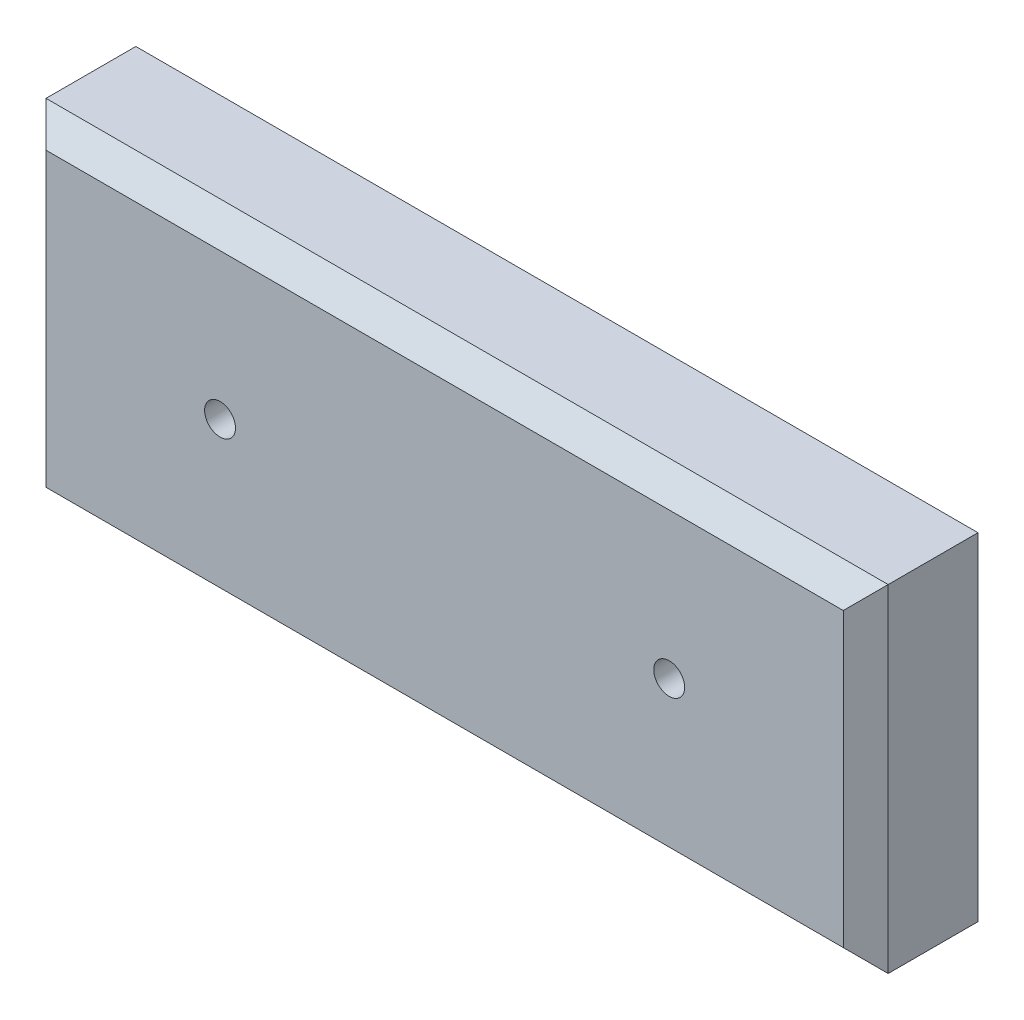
ISO-10303-21;
HEADER;
FILE_DESCRIPTION(('STEP AP214'),'2;1');
FILE_NAME('part.step','',(''),(''),'','','');
FILE_SCHEMA(('AUTOMOTIVE_DESIGN { 1 0 10303 214 1 1 1 1 }'));
ENDSEC;
DATA;
#1=APPLICATION_CONTEXT('core data for automotive mechanical design processes');
#2=APPLICATION_PROTOCOL_DEFINITION('international standard','automotive_design',2000,#1);
#3=PRODUCT_CONTEXT('',#1,'mechanical');
#4=PRODUCT('Part','Part','',(#3));
#5=PRODUCT_RELATED_PRODUCT_CATEGORY('part','',(#4));
#6=PRODUCT_DEFINITION_FORMATION('','',#4);
#7=PRODUCT_DEFINITION_CONTEXT('part definition',#1,'design');
#8=PRODUCT_DEFINITION('design','',#6,#7);
#9=PRODUCT_DEFINITION_SHAPE('','',#8);
#10=(LENGTH_UNIT() NAMED_UNIT(*) SI_UNIT(.MILLI.,.METRE.));
#11=(NAMED_UNIT(*) PLANE_ANGLE_UNIT() SI_UNIT($,.RADIAN.));
#12=(NAMED_UNIT(*) SI_UNIT($,.STERADIAN.) SOLID_ANGLE_UNIT());
#13=UNCERTAINTY_MEASURE_WITH_UNIT(LENGTH_MEASURE(1.E-05),#10,'distance_accuracy_value','');
#14=(GEOMETRIC_REPRESENTATION_CONTEXT(3) GLOBAL_UNCERTAINTY_ASSIGNED_CONTEXT((#13)) GLOBAL_UNIT_ASSIGNED_CONTEXT((#10,
#11,#12)) REPRESENTATION_CONTEXT('',''));
#15=CARTESIAN_POINT('',(0.,0.,0.));
#16=DIRECTION('',(0.,0.,1.));
#17=DIRECTION('',(1.,0.,0.));
#18=AXIS2_PLACEMENT_3D('',#15,#16,#17);
#19=CARTESIAN_POINT('',(-75.,-30.0000000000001,19.9999999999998));
#20=DIRECTION('',(0.,1.,0.));
#21=DIRECTION('',(0.,0.,0.999999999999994));
#22=AXIS2_PLACEMENT_3D('',#19,#20,#21);
#23=PLANE('',#22);
#24=DIRECTION('',(0.,0.,-0.999999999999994));
#25=VECTOR('',#24,1.);
#26=CARTESIAN_POINT('',(75.,-29.9999999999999,19.9999999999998));
#27=LINE('',#26,#25);
#28=CARTESIAN_POINT('',(75.,-29.9999999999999,15.9999999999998));
#29=VERTEX_POINT('',#28);
#30=CARTESIAN_POINT('',(75.,-29.9999999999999,0.));
#31=VERTEX_POINT('',#30);
#32=EDGE_CURVE('E100',#29,#31,#27,.T.);
#33=ORIENTED_EDGE('',*,*,#32,.F.);
#34=DIRECTION('',(-1.,0.,0.));
#35=VECTOR('',#34,1.);
#36=CARTESIAN_POINT('',(-75.,-30.0000000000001,15.9999999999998));
#37=LINE('',#36,#35);
#38=CARTESIAN_POINT('',(-75.,-30.0000000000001,15.9999999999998));
#39=VERTEX_POINT('',#38);
#40=EDGE_CURVE('E147',#29,#39,#37,.T.);
#41=ORIENTED_EDGE('',*,*,#40,.T.);
#42=DIRECTION('',(0.,0.,-0.999999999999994));
#43=VECTOR('',#42,1.);
#44=CARTESIAN_POINT('',(-75.,-30.0000000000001,19.9999999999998));
#45=LINE('',#44,#43);
#46=CARTESIAN_POINT('',(-75.,-30.0000000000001,0.));
#47=VERTEX_POINT('',#46);
#48=EDGE_CURVE('E120',#39,#47,#45,.T.);
#49=ORIENTED_EDGE('',*,*,#48,.T.);
#50=DIRECTION('',(1.,0.,0.));
#51=VECTOR('',#50,1.);
#52=CARTESIAN_POINT('',(-75.,-30.0000000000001,0.));
#53=LINE('',#52,#51);
#54=EDGE_CURVE('E115',#47,#31,#53,.T.);
#55=ORIENTED_EDGE('',*,*,#54,.T.);
#56=EDGE_LOOP('',(#33,#41,#49,#55));
#57=FACE_BOUND('',#56,.T.);
#58=ADVANCED_FACE('F49',(#57),#23,.F.);
#59=CARTESIAN_POINT('',(75.,30.0000000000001,19.9999999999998));
#60=DIRECTION('',(-1.,0.,0.));
#61=DIRECTION('',(0.,-1.,0.));
#62=AXIS2_PLACEMENT_3D('',#59,#60,#61);
#63=PLANE('',#62);
#64=DIRECTION('',(0.,0.,-0.999999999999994));
#65=VECTOR('',#64,1.);
#66=CARTESIAN_POINT('',(75.,30.0000000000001,19.9999999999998));
#67=LINE('',#66,#65);
#68=CARTESIAN_POINT('',(75.,30.0000000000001,15.9999999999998));
#69=VERTEX_POINT('',#68);
#70=CARTESIAN_POINT('',(75.,30.0000000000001,0.));
#71=VERTEX_POINT('',#70);
#72=EDGE_CURVE('E109',#69,#71,#67,.T.);
#73=ORIENTED_EDGE('',*,*,#72,.F.);
#74=DIRECTION('',(0.,-1.,0.));
#75=VECTOR('',#74,1.);
#76=CARTESIAN_POINT('',(75.,30.0000000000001,15.9999999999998));
#77=LINE('',#76,#75);
#78=EDGE_CURVE('E58',#69,#29,#77,.T.);
#79=ORIENTED_EDGE('',*,*,#78,.T.);
#80=ORIENTED_EDGE('',*,*,#32,.T.);
#81=DIRECTION('',(0.,1.,0.));
#82=VECTOR('',#81,1.);
#83=CARTESIAN_POINT('',(75.,30.0000000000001,0.));
#84=LINE('',#83,#82);
#85=EDGE_CURVE('E103',#31,#71,#84,.T.);
#86=ORIENTED_EDGE('',*,*,#85,.T.);
#87=EDGE_LOOP('',(#73,#79,#80,#86));
#88=FACE_BOUND('',#87,.T.);
#89=ADVANCED_FACE('F102',(#88),#63,.F.);
#90=CARTESIAN_POINT('',(-75.,29.9999999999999,19.9999999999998));
#91=DIRECTION('',(0.,-1.,0.));
#92=DIRECTION('',(0.,0.,-0.999999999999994));
#93=AXIS2_PLACEMENT_3D('',#90,#91,#92);
#94=PLANE('',#93);
#95=DIRECTION('',(0.,0.,-0.999999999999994));
#96=VECTOR('',#95,1.);
#97=CARTESIAN_POINT('',(-75.,29.9999999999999,19.9999999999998));
#98=LINE('',#97,#96);
#99=CARTESIAN_POINT('',(-75.,29.9999999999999,15.9999999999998));
#100=VERTEX_POINT('',#99);
#101=CARTESIAN_POINT('',(-75.,29.9999999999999,0.));
#102=VERTEX_POINT('',#101);
#103=EDGE_CURVE('E133',#100,#102,#98,.T.);
#104=ORIENTED_EDGE('',*,*,#103,.F.);
#105=DIRECTION('',(1.,0.,0.));
#106=VECTOR('',#105,1.);
#107=CARTESIAN_POINT('',(-75.,29.9999999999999,15.9999999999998));
#108=LINE('',#107,#106);
#109=EDGE_CURVE('E13',#100,#69,#108,.T.);
#110=ORIENTED_EDGE('',*,*,#109,.T.);
#111=ORIENTED_EDGE('',*,*,#72,.T.);
#112=DIRECTION('',(-1.,0.,0.));
#113=VECTOR('',#112,1.);
#114=CARTESIAN_POINT('',(-75.,29.9999999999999,0.));
#115=LINE('',#114,#113);
#116=EDGE_CURVE('E117',#71,#102,#115,.T.);
#117=ORIENTED_EDGE('',*,*,#116,.T.);
#118=EDGE_LOOP('',(#104,#110,#111,#117));
#119=FACE_BOUND('',#118,.T.);
#120=ADVANCED_FACE('F172',(#119),#94,.F.);
#121=CARTESIAN_POINT('',(-75.,29.9999999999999,19.9999999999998));
#122=DIRECTION('',(1.,0.,0.));
#123=DIRECTION('',(0.,0.,-0.999999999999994));
#124=AXIS2_PLACEMENT_3D('',#121,#122,#123);
#125=PLANE('',#124);
#126=ORIENTED_EDGE('',*,*,#48,.F.);
#127=DIRECTION('',(0.,1.,0.));
#128=VECTOR('',#127,1.);
#129=CARTESIAN_POINT('',(-75.,29.9999999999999,15.9999999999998));
#130=LINE('',#129,#128);
#131=EDGE_CURVE('E144',#39,#100,#130,.T.);
#132=ORIENTED_EDGE('',*,*,#131,.T.);
#133=ORIENTED_EDGE('',*,*,#103,.T.);
#134=DIRECTION('',(0.,-1.,0.));
#135=VECTOR('',#134,1.);
#136=CARTESIAN_POINT('',(-75.,29.9999999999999,0.));
#137=LINE('',#136,#135);
#138=EDGE_CURVE('E130',#102,#47,#137,.T.);
#139=ORIENTED_EDGE('',*,*,#138,.T.);
#140=EDGE_LOOP('',(#126,#132,#133,#139));
#141=FACE_BOUND('',#140,.T.);
#142=ADVANCED_FACE('F171',(#141),#125,.F.);
#143=CARTESIAN_POINT('',(75.,-29.9999999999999,19.9999999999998));
#144=DIRECTION('',(0.,0.,-0.999999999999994));
#145=DIRECTION('',(-1.,0.,0.));
#146=AXIS2_PLACEMENT_3D('',#143,#144,#145);
#147=PLANE('',#146);
#148=CARTESIAN_POINT('',(40.,0.,19.9999999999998));
#149=DIRECTION('',(0.,0.,-0.999999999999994));
#150=DIRECTION('',(-1.,0.,0.));
#151=AXIS2_PLACEMENT_3D('',#148,#149,#150);
#152=CIRCLE('',#151,2.75);
#153=CARTESIAN_POINT('',(37.25,0.,19.9999999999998));
#154=VERTEX_POINT('',#153);
#155=EDGE_CURVE('E245',#154,#154,#152,.T.);
#156=ORIENTED_EDGE('',*,*,#155,.T.);
#157=EDGE_LOOP('',(#156));
#158=FACE_BOUND('',#157,.T.);
#159=CARTESIAN_POINT('',(-40.,0.,19.9999999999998));
#160=DIRECTION('',(0.,0.,-0.999999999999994));
#161=DIRECTION('',(-1.,0.,0.));
#162=AXIS2_PLACEMENT_3D('',#159,#160,#161);
#163=CIRCLE('',#162,2.75);
#164=CARTESIAN_POINT('',(-42.75,0.,19.9999999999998));
#165=VERTEX_POINT('',#164);
#166=EDGE_CURVE('E126',#165,#165,#163,.T.);
#167=ORIENTED_EDGE('',*,*,#166,.T.);
#168=EDGE_LOOP('',(#167));
#169=FACE_BOUND('',#168,.T.);
#170=DIRECTION('',(-1.,0.,0.));
#171=VECTOR('',#170,1.);
#172=CARTESIAN_POINT('',(75.,26.0000000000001,19.9999999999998));
#173=LINE('',#172,#171);
#174=CARTESIAN_POINT('',(71.,26.0000000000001,19.9999999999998));
#175=VERTEX_POINT('',#174);
#176=CARTESIAN_POINT('',(-71.,25.9999999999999,19.9999999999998));
#177=VERTEX_POINT('',#176);
#178=EDGE_CURVE('E108',#175,#177,#173,.T.);
#179=ORIENTED_EDGE('',*,*,#178,.T.);
#180=DIRECTION('',(0.,-1.,0.));
#181=VECTOR('',#180,1.);
#182=CARTESIAN_POINT('',(-71.,-30.0000000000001,19.9999999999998));
#183=LINE('',#182,#181);
#184=CARTESIAN_POINT('',(-71.,-26.0000000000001,19.9999999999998));
#185=VERTEX_POINT('',#184);
#186=EDGE_CURVE('E141',#177,#185,#183,.T.);
#187=ORIENTED_EDGE('',*,*,#186,.T.);
#188=DIRECTION('',(1.,0.,0.));
#189=VECTOR('',#188,1.);
#190=CARTESIAN_POINT('',(75.,-25.9999999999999,19.9999999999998));
#191=LINE('',#190,#189);
#192=CARTESIAN_POINT('',(71.,-25.9999999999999,19.9999999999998));
#193=VERTEX_POINT('',#192);
#194=EDGE_CURVE('E139',#185,#193,#191,.T.);
#195=ORIENTED_EDGE('',*,*,#194,.T.);
#196=DIRECTION('',(0.,1.,0.));
#197=VECTOR('',#196,1.);
#198=CARTESIAN_POINT('',(71.,-29.9999999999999,19.9999999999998));
#199=LINE('',#198,#197);
#200=EDGE_CURVE('E137',#193,#175,#199,.T.);
#201=ORIENTED_EDGE('',*,*,#200,.T.);
#202=EDGE_LOOP('',(#179,#187,#195,#201));
#203=FACE_BOUND('',#202,.T.);
#204=ADVANCED_FACE('F164',(#158,#169,#203),#147,.F.);
#205=CARTESIAN_POINT('',(75.,-29.9999999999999,0.));
#206=DIRECTION('',(0.,0.,-0.999999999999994));
#207=DIRECTION('',(-1.,0.,0.));
#208=AXIS2_PLACEMENT_3D('',#205,#206,#207);
#209=PLANE('',#208);
#210=CARTESIAN_POINT('',(40.,0.,0.));
#211=DIRECTION('',(0.,0.,-0.999999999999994));
#212=DIRECTION('',(-1.,0.,0.));
#213=AXIS2_PLACEMENT_3D('',#210,#211,#212);
#214=CIRCLE('',#213,5.);
#215=CARTESIAN_POINT('',(35.,0.,0.));
#216=VERTEX_POINT('',#215);
#217=EDGE_CURVE('E238',#216,#216,#214,.T.);
#218=ORIENTED_EDGE('',*,*,#217,.F.);
#219=EDGE_LOOP('',(#218));
#220=FACE_BOUND('',#219,.T.);
#221=CARTESIAN_POINT('',(-40.,0.,0.));
#222=DIRECTION('',(0.,0.,-0.999999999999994));
#223=DIRECTION('',(-1.,0.,0.));
#224=AXIS2_PLACEMENT_3D('',#221,#222,#223);
#225=CIRCLE('',#224,5.);
#226=CARTESIAN_POINT('',(-45.,0.,0.));
#227=VERTEX_POINT('',#226);
#228=EDGE_CURVE('E248',#227,#227,#225,.T.);
#229=ORIENTED_EDGE('',*,*,#228,.F.);
#230=EDGE_LOOP('',(#229));
#231=FACE_BOUND('',#230,.T.);
#232=ORIENTED_EDGE('',*,*,#54,.F.);
#233=ORIENTED_EDGE('',*,*,#138,.F.);
#234=ORIENTED_EDGE('',*,*,#116,.F.);
#235=ORIENTED_EDGE('',*,*,#85,.F.);
#236=EDGE_LOOP('',(#232,#233,#234,#235));
#237=FACE_BOUND('',#236,.T.);
#238=ADVANCED_FACE('F113',(#220,#231,#237),#209,.T.);
#239=CARTESIAN_POINT('',(71.,-29.9999999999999,19.9999999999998));
#240=DIRECTION('',(-0.707106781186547,0.,-0.707106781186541));
#241=DIRECTION('',(-0.707106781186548,0.,0.707106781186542));
#242=AXIS2_PLACEMENT_3D('',#239,#240,#241);
#243=PLANE('',#242);
#244=DIRECTION('',(0.577350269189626,-0.577350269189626,-0.57735026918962));
#245=VECTOR('',#244,1.);
#246=CARTESIAN_POINT('',(72.3333333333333,-27.3333333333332,18.6666666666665));
#247=LINE('',#246,#245);
#248=EDGE_CURVE('E124',#29,#193,#247,.F.);
#249=ORIENTED_EDGE('',*,*,#248,.F.);
#250=ORIENTED_EDGE('',*,*,#78,.F.);
#251=DIRECTION('',(0.577350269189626,0.577350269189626,-0.57735026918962));
#252=VECTOR('',#251,1.);
#253=CARTESIAN_POINT('',(72.3333333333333,27.3333333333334,18.6666666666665));
#254=LINE('',#253,#252);
#255=EDGE_CURVE('E53',#175,#69,#254,.T.);
#256=ORIENTED_EDGE('',*,*,#255,.F.);
#257=ORIENTED_EDGE('',*,*,#200,.F.);
#258=EDGE_LOOP('',(#249,#250,#256,#257));
#259=FACE_BOUND('',#258,.T.);
#260=ADVANCED_FACE('F51',(#259),#243,.F.);
#261=CARTESIAN_POINT('',(75.,26.0000000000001,19.9999999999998));
#262=DIRECTION('',(0.,-0.707106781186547,-0.707106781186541));
#263=DIRECTION('',(0.,0.707106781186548,-0.707106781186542));
#264=AXIS2_PLACEMENT_3D('',#261,#262,#263);
#265=PLANE('',#264);
#266=ORIENTED_EDGE('',*,*,#255,.T.);
#267=ORIENTED_EDGE('',*,*,#109,.F.);
#268=DIRECTION('',(0.577350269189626,-0.577350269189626,0.57735026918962));
#269=VECTOR('',#268,1.);
#270=CARTESIAN_POINT('',(-22.3333333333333,-22.6666666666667,68.6666666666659));
#271=LINE('',#270,#269);
#272=EDGE_CURVE('E152',#177,#100,#271,.F.);
#273=ORIENTED_EDGE('',*,*,#272,.F.);
#274=ORIENTED_EDGE('',*,*,#178,.F.);
#275=EDGE_LOOP('',(#266,#267,#273,#274));
#276=FACE_BOUND('',#275,.T.);
#277=ADVANCED_FACE('F190',(#276),#265,.F.);
#278=CARTESIAN_POINT('',(75.,-25.9999999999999,19.9999999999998));
#279=DIRECTION('',(0.,0.707106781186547,-0.707106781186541));
#280=DIRECTION('',(0.,0.707106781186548,0.707106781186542));
#281=AXIS2_PLACEMENT_3D('',#278,#279,#280);
#282=PLANE('',#281);
#283=ORIENTED_EDGE('',*,*,#248,.T.);
#284=ORIENTED_EDGE('',*,*,#194,.F.);
#285=DIRECTION('',(-0.577350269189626,-0.577350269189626,-0.57735026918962));
#286=VECTOR('',#285,1.);
#287=CARTESIAN_POINT('',(-22.3333333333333,22.6666666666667,68.6666666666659));
#288=LINE('',#287,#286);
#289=EDGE_CURVE('E150',#39,#185,#288,.F.);
#290=ORIENTED_EDGE('',*,*,#289,.F.);
#291=ORIENTED_EDGE('',*,*,#40,.F.);
#292=EDGE_LOOP('',(#283,#284,#290,#291));
#293=FACE_BOUND('',#292,.T.);
#294=ADVANCED_FACE('F157',(#293),#282,.F.);
#295=CARTESIAN_POINT('',(-71.,-30.0000000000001,19.9999999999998));
#296=DIRECTION('',(0.707106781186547,0.,-0.707106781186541));
#297=DIRECTION('',(-0.707106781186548,0.,-0.707106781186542));
#298=AXIS2_PLACEMENT_3D('',#295,#296,#297);
#299=PLANE('',#298);
#300=ORIENTED_EDGE('',*,*,#272,.T.);
#301=ORIENTED_EDGE('',*,*,#131,.F.);
#302=ORIENTED_EDGE('',*,*,#289,.T.);
#303=ORIENTED_EDGE('',*,*,#186,.F.);
#304=EDGE_LOOP('',(#300,#301,#302,#303));
#305=FACE_BOUND('',#304,.T.);
#306=ADVANCED_FACE('F168',(#305),#299,.F.);
#307=CARTESIAN_POINT('',(-40.,0.,0.));
#308=DIRECTION('',(0.,0.,-0.999999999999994));
#309=DIRECTION('',(-1.,0.,0.));
#310=AXIS2_PLACEMENT_3D('',#307,#308,#309);
#311=CYLINDRICAL_SURFACE('',#310,2.75);
#312=CARTESIAN_POINT('',(-40.,0.,4.99999999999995));
#313=DIRECTION('',(0.,0.,-0.999999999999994));
#314=DIRECTION('',(-1.,0.,0.));
#315=AXIS2_PLACEMENT_3D('',#312,#313,#314);
#316=CIRCLE('',#315,2.75);
#317=CARTESIAN_POINT('',(-42.75,0.,4.99999999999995));
#318=VERTEX_POINT('',#317);
#319=EDGE_CURVE('E253',#318,#318,#316,.T.);
#320=CARTESIAN_POINT('',(-42.75,0.,19.9999999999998));
#321=CARTESIAN_POINT('',(-42.75,0.,19.8437499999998));
#322=CARTESIAN_POINT('',(-42.75,0.,19.6874999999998));
#323=CARTESIAN_POINT('',(-42.75,0.,19.3749999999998));
#324=CARTESIAN_POINT('',(-42.75,0.,19.2187499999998));
#325=CARTESIAN_POINT('',(-42.75,0.,18.9062499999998));
#326=CARTESIAN_POINT('',(-42.75,0.,18.7499999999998));
#327=CARTESIAN_POINT('',(-42.75,0.,18.4374999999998));
#328=CARTESIAN_POINT('',(-42.75,0.,18.2812499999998));
#329=CARTESIAN_POINT('',(-42.75,0.,17.9687499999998));
#330=CARTESIAN_POINT('',(-42.75,0.,17.8124999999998));
#331=CARTESIAN_POINT('',(-42.75,0.,17.4999999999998));
#332=CARTESIAN_POINT('',(-42.75,0.,17.3437499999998));
#333=CARTESIAN_POINT('',(-42.75,0.,17.0312499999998));
#334=CARTESIAN_POINT('',(-42.75,0.,16.8749999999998));
#335=CARTESIAN_POINT('',(-42.75,0.,16.5624999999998));
#336=CARTESIAN_POINT('',(-42.75,0.,16.4062499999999));
#337=CARTESIAN_POINT('',(-42.75,0.,16.0937499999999));
#338=CARTESIAN_POINT('',(-42.75,0.,15.9374999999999));
#339=CARTESIAN_POINT('',(-42.75,0.,15.6249999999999));
#340=CARTESIAN_POINT('',(-42.75,0.,15.4687499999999));
#341=CARTESIAN_POINT('',(-42.75,0.,15.1562499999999));
#342=CARTESIAN_POINT('',(-42.75,0.,14.9999999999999));
#343=CARTESIAN_POINT('',(-42.75,0.,14.6874999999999));
#344=CARTESIAN_POINT('',(-42.75,0.,14.5312499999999));
#345=CARTESIAN_POINT('',(-42.75,0.,14.2187499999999));
#346=CARTESIAN_POINT('',(-42.75,0.,14.0624999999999));
#347=CARTESIAN_POINT('',(-42.75,0.,13.7499999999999));
#348=CARTESIAN_POINT('',(-42.75,0.,13.5937499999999));
#349=CARTESIAN_POINT('',(-42.75,0.,13.2812499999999));
#350=CARTESIAN_POINT('',(-42.75,0.,13.1249999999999));
#351=CARTESIAN_POINT('',(-42.75,0.,12.8124999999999));
#352=CARTESIAN_POINT('',(-42.75,0.,12.6562499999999));
#353=CARTESIAN_POINT('',(-42.75,0.,12.3437499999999));
#354=CARTESIAN_POINT('',(-42.75,0.,12.1874999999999));
#355=CARTESIAN_POINT('',(-42.75,0.,11.8749999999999));
#356=CARTESIAN_POINT('',(-42.75,0.,11.7187499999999));
#357=CARTESIAN_POINT('',(-42.75,0.,11.4062499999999));
#358=CARTESIAN_POINT('',(-42.75,0.,11.2499999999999));
#359=CARTESIAN_POINT('',(-42.75,0.,10.9374999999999));
#360=CARTESIAN_POINT('',(-42.75,0.,10.7812499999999));
#361=CARTESIAN_POINT('',(-42.75,0.,10.4687499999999));
#362=CARTESIAN_POINT('',(-42.75,0.,10.3124999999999));
#363=CARTESIAN_POINT('',(-42.75,0.,9.99999999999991));
#364=CARTESIAN_POINT('',(-42.75,0.,9.84374999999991));
#365=CARTESIAN_POINT('',(-42.75,0.,9.53124999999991));
#366=CARTESIAN_POINT('',(-42.75,0.,9.37499999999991));
#367=CARTESIAN_POINT('',(-42.75,0.,9.06249999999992));
#368=CARTESIAN_POINT('',(-42.75,0.,8.90624999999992));
#369=CARTESIAN_POINT('',(-42.75,0.,8.59374999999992));
#370=CARTESIAN_POINT('',(-42.75,0.,8.43749999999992));
#371=CARTESIAN_POINT('',(-42.75,0.,8.12499999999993));
#372=CARTESIAN_POINT('',(-42.75,0.,7.96874999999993));
#373=CARTESIAN_POINT('',(-42.75,0.,7.65624999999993));
#374=CARTESIAN_POINT('',(-42.75,0.,7.49999999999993));
#375=CARTESIAN_POINT('',(-42.75,0.,7.18749999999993));
#376=CARTESIAN_POINT('',(-42.75,0.,7.03124999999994));
#377=CARTESIAN_POINT('',(-42.75,0.,6.71874999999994));
#378=CARTESIAN_POINT('',(-42.75,0.,6.56249999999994));
#379=CARTESIAN_POINT('',(-42.75,0.,6.24999999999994));
#380=CARTESIAN_POINT('',(-42.75,0.,6.09374999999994));
#381=CARTESIAN_POINT('',(-42.75,0.,5.78124999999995));
#382=CARTESIAN_POINT('',(-42.75,0.,5.62499999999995));
#383=CARTESIAN_POINT('',(-42.75,0.,5.31249999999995));
#384=CARTESIAN_POINT('',(-42.75,0.,5.15624999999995));
#385=CARTESIAN_POINT('',(-42.75,0.,4.99999999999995));
#386=B_SPLINE_CURVE_WITH_KNOTS('',3,(#320,#321,#322,#323,#324,#325,#326,#327,#328,#329,#330,
#331,#332,#333,#334,#335,#336,#337,#338,#339,#340,#341,#342,#343,#344,#345,#346,#347,#348,#349,
#350,#351,#352,#353,#354,#355,#356,#357,#358,#359,#360,#361,#362,#363,#364,#365,#366,#367,#368,
#369,#370,#371,#372,#373,#374,#375,#376,#377,#378,#379,#380,#381,#382,#383,#384,#385),
.UNSPECIFIED.,.F.,.F.,(4,2,2,2,2,2,2,2,2,2,2,2,2,2,2,2,2,2,2,2,2,2,2,2,2,2,2,2,2,2,2,2,4),(0.,
0.468749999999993,0.93749999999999,1.40624999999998,1.87499999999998,2.34374999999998,
2.81249999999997,3.28124999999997,3.74999999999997,4.21874999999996,4.68749999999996,
5.15624999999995,5.62499999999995,6.09374999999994,6.56249999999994,7.03124999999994,
7.49999999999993,7.96874999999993,8.43749999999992,8.90624999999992,9.37499999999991,
9.84374999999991,10.3124999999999,10.7812499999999,11.2499999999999,11.7187499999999,
12.1874999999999,12.6562499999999,13.1249999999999,13.5937499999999,14.0624999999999,
14.5312499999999,14.9999999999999),.UNSPECIFIED.);
#387=EDGE_CURVE('BSEAM188',#165,#318,#386,.T.);
#388=ORIENTED_EDGE('',*,*,#166,.F.);
#389=ORIENTED_EDGE('',*,*,#319,.T.);
#390=ORIENTED_EDGE('',*,*,#387,.T.);
#391=ORIENTED_EDGE('',*,*,#387,.F.);
#392=EDGE_LOOP('',(#388,#390,#389,#391));
#393=FACE_BOUND('',#392,.T.);
#394=ADVANCED_FACE('F188',(#393),#311,.F.);
#395=CARTESIAN_POINT('',(-37.25,0.,4.99999999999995));
#396=DIRECTION('',(0.,0.,0.999999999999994));
#397=DIRECTION('',(1.,0.,0.));
#398=AXIS2_PLACEMENT_3D('',#395,#396,#397);
#399=PLANE('',#398);
#400=ORIENTED_EDGE('',*,*,#319,.F.);
#401=EDGE_LOOP('',(#400));
#402=FACE_BOUND('',#401,.T.);
#403=CARTESIAN_POINT('',(-40.,0.,4.99999999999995));
#404=DIRECTION('',(0.,0.,-0.999999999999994));
#405=DIRECTION('',(-1.,0.,0.));
#406=AXIS2_PLACEMENT_3D('',#403,#404,#405);
#407=CIRCLE('',#406,5.);
#408=CARTESIAN_POINT('',(-45.,0.,4.99999999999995));
#409=VERTEX_POINT('',#408);
#410=EDGE_CURVE('E251',#409,#409,#407,.T.);
#411=ORIENTED_EDGE('',*,*,#410,.T.);
#412=EDGE_LOOP('',(#411));
#413=FACE_BOUND('',#412,.T.);
#414=ADVANCED_FACE('F211',(#402,#413),#399,.F.);
#415=CARTESIAN_POINT('',(-40.,0.,0.));
#416=DIRECTION('',(0.,0.,-0.999999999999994));
#417=DIRECTION('',(-1.,0.,0.));
#418=AXIS2_PLACEMENT_3D('',#415,#416,#417);
#419=CYLINDRICAL_SURFACE('',#418,5.);
#420=CARTESIAN_POINT('',(-45.,0.,4.99999999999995));
#421=CARTESIAN_POINT('',(-45.,0.,4.94791666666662));
#422=CARTESIAN_POINT('',(-45.,0.,4.89583333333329));
#423=CARTESIAN_POINT('',(-45.,0.,4.79166666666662));
#424=CARTESIAN_POINT('',(-45.,0.,4.73958333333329));
#425=CARTESIAN_POINT('',(-45.,0.,4.63541666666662));
#426=CARTESIAN_POINT('',(-45.,0.,4.58333333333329));
#427=CARTESIAN_POINT('',(-45.,0.,4.47916666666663));
#428=CARTESIAN_POINT('',(-45.,0.,4.42708333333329));
#429=CARTESIAN_POINT('',(-45.,0.,4.32291666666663));
#430=CARTESIAN_POINT('',(-45.,0.,4.27083333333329));
#431=CARTESIAN_POINT('',(-45.,0.,4.16666666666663));
#432=CARTESIAN_POINT('',(-45.,0.,4.1145833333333));
#433=CARTESIAN_POINT('',(-45.,0.,4.01041666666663));
#434=CARTESIAN_POINT('',(-45.,0.,3.9583333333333));
#435=CARTESIAN_POINT('',(-45.,0.,3.85416666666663));
#436=CARTESIAN_POINT('',(-45.,0.,3.8020833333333));
#437=CARTESIAN_POINT('',(-45.,0.,3.69791666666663));
#438=CARTESIAN_POINT('',(-45.,0.,3.6458333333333));
#439=CARTESIAN_POINT('',(-45.,0.,3.54166666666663));
#440=CARTESIAN_POINT('',(-45.,0.,3.4895833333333));
#441=CARTESIAN_POINT('',(-45.,0.,3.38541666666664));
#442=CARTESIAN_POINT('',(-45.,0.,3.3333333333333));
#443=CARTESIAN_POINT('',(-45.,0.,3.22916666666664));
#444=CARTESIAN_POINT('',(-45.,0.,3.17708333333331));
#445=CARTESIAN_POINT('',(-45.,0.,3.07291666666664));
#446=CARTESIAN_POINT('',(-45.,0.,3.02083333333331));
#447=CARTESIAN_POINT('',(-45.,0.,2.91666666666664));
#448=CARTESIAN_POINT('',(-45.,0.,2.86458333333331));
#449=CARTESIAN_POINT('',(-45.,0.,2.76041666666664));
#450=CARTESIAN_POINT('',(-45.,0.,2.70833333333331));
#451=CARTESIAN_POINT('',(-45.,0.,2.60416666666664));
#452=CARTESIAN_POINT('',(-45.,0.,2.55208333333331));
#453=CARTESIAN_POINT('',(-45.,0.,2.44791666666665));
#454=CARTESIAN_POINT('',(-45.,0.,2.39583333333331));
#455=CARTESIAN_POINT('',(-45.,0.,2.29166666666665));
#456=CARTESIAN_POINT('',(-45.,0.,2.23958333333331));
#457=CARTESIAN_POINT('',(-45.,0.,2.13541666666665));
#458=CARTESIAN_POINT('',(-45.,0.,2.08333333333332));
#459=CARTESIAN_POINT('',(-45.,0.,1.97916666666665));
#460=CARTESIAN_POINT('',(-45.,0.,1.92708333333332));
#461=CARTESIAN_POINT('',(-45.,0.,1.82291666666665));
#462=CARTESIAN_POINT('',(-45.,0.,1.77083333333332));
#463=CARTESIAN_POINT('',(-45.,0.,1.66666666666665));
#464=CARTESIAN_POINT('',(-45.,0.,1.61458333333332));
#465=CARTESIAN_POINT('',(-45.,0.,1.51041666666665));
#466=CARTESIAN_POINT('',(-45.,0.,1.45833333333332));
#467=CARTESIAN_POINT('',(-45.,0.,1.35416666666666));
#468=CARTESIAN_POINT('',(-45.,0.,1.30208333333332));
#469=CARTESIAN_POINT('',(-45.,0.,1.19791666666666));
#470=CARTESIAN_POINT('',(-45.,0.,1.14583333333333));
#471=CARTESIAN_POINT('',(-45.,0.,1.04166666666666));
#472=CARTESIAN_POINT('',(-45.,0.,0.989583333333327));
#473=CARTESIAN_POINT('',(-45.,0.,0.885416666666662));
#474=CARTESIAN_POINT('',(-45.,0.,0.833333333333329));
#475=CARTESIAN_POINT('',(-45.,0.,0.729166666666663));
#476=CARTESIAN_POINT('',(-45.,0.,0.67708333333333));
#477=CARTESIAN_POINT('',(-45.,0.,0.572916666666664));
#478=CARTESIAN_POINT('',(-45.,0.,0.520833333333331));
#479=CARTESIAN_POINT('',(-45.,0.,0.416666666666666));
#480=CARTESIAN_POINT('',(-45.,0.,0.364583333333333));
#481=CARTESIAN_POINT('',(-45.,0.,0.260416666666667));
#482=CARTESIAN_POINT('',(-45.,0.,0.208333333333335));
#483=CARTESIAN_POINT('',(-45.,0.,0.104166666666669));
#484=CARTESIAN_POINT('',(-45.,0.,0.0520833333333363));
#485=CARTESIAN_POINT('',(-45.,0.,0.));
#486=B_SPLINE_CURVE_WITH_KNOTS('',3,(#420,#421,#422,#423,#424,#425,#426,#427,#428,#429,#430,
#431,#432,#433,#434,#435,#436,#437,#438,#439,#440,#441,#442,#443,#444,#445,#446,#447,#448,#449,
#450,#451,#452,#453,#454,#455,#456,#457,#458,#459,#460,#461,#462,#463,#464,#465,#466,#467,#468,
#469,#470,#471,#472,#473,#474,#475,#476,#477,#478,#479,#480,#481,#482,#483,#484,#485),
.UNSPECIFIED.,.F.,.F.,(4,2,2,2,2,2,2,2,2,2,2,2,2,2,2,2,2,2,2,2,2,2,2,2,2,2,2,2,2,2,2,2,4),(0.,
0.156249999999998,0.312499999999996,0.468749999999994,0.624999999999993,0.781249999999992,
0.93749999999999,1.09374999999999,1.24999999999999,1.40624999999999,1.56249999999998,
1.71874999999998,1.87499999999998,2.03124999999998,2.18749999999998,2.34374999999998,
2.49999999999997,2.65624999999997,2.81249999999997,2.96874999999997,3.12499999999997,
3.28124999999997,3.43749999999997,3.59374999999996,3.74999999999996,3.90624999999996,
4.06249999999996,4.21874999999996,4.37499999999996,4.53124999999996,4.68749999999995,
4.84374999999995,4.99999999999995),.UNSPECIFIED.);
#487=EDGE_CURVE('BSEAM215',#409,#227,#486,.T.);
#488=ORIENTED_EDGE('',*,*,#410,.F.);
#489=ORIENTED_EDGE('',*,*,#228,.T.);
#490=ORIENTED_EDGE('',*,*,#487,.T.);
#491=ORIENTED_EDGE('',*,*,#487,.F.);
#492=EDGE_LOOP('',(#488,#490,#489,#491));
#493=FACE_BOUND('',#492,.T.);
#494=ADVANCED_FACE('F215',(#493),#419,.F.);
#495=CARTESIAN_POINT('',(40.,0.,0.));
#496=DIRECTION('',(0.,0.,-0.999999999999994));
#497=DIRECTION('',(-1.,0.,0.));
#498=AXIS2_PLACEMENT_3D('',#495,#496,#497);
#499=CYLINDRICAL_SURFACE('',#498,2.75);
#500=CARTESIAN_POINT('',(40.,0.,4.99999999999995));
#501=DIRECTION('',(0.,0.,-0.999999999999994));
#502=DIRECTION('',(-1.,0.,0.));
#503=AXIS2_PLACEMENT_3D('',#500,#501,#502);
#504=CIRCLE('',#503,2.75);
#505=CARTESIAN_POINT('',(37.25,0.,4.99999999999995));
#506=VERTEX_POINT('',#505);
#507=EDGE_CURVE('E240',#506,#506,#504,.T.);
#508=CARTESIAN_POINT('',(37.25,0.,19.9999999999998));
#509=CARTESIAN_POINT('',(37.25,0.,19.8437499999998));
#510=CARTESIAN_POINT('',(37.25,0.,19.6874999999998));
#511=CARTESIAN_POINT('',(37.25,0.,19.3749999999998));
#512=CARTESIAN_POINT('',(37.25,0.,19.2187499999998));
#513=CARTESIAN_POINT('',(37.25,0.,18.9062499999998));
#514=CARTESIAN_POINT('',(37.25,0.,18.7499999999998));
#515=CARTESIAN_POINT('',(37.25,0.,18.4374999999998));
#516=CARTESIAN_POINT('',(37.25,0.,18.2812499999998));
#517=CARTESIAN_POINT('',(37.25,0.,17.9687499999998));
#518=CARTESIAN_POINT('',(37.25,0.,17.8124999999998));
#519=CARTESIAN_POINT('',(37.25,0.,17.4999999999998));
#520=CARTESIAN_POINT('',(37.25,0.,17.3437499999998));
#521=CARTESIAN_POINT('',(37.25,0.,17.0312499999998));
#522=CARTESIAN_POINT('',(37.25,0.,16.8749999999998));
#523=CARTESIAN_POINT('',(37.25,0.,16.5624999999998));
#524=CARTESIAN_POINT('',(37.25,0.,16.4062499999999));
#525=CARTESIAN_POINT('',(37.25,0.,16.0937499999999));
#526=CARTESIAN_POINT('',(37.25,0.,15.9374999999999));
#527=CARTESIAN_POINT('',(37.25,0.,15.6249999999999));
#528=CARTESIAN_POINT('',(37.25,0.,15.4687499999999));
#529=CARTESIAN_POINT('',(37.25,0.,15.1562499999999));
#530=CARTESIAN_POINT('',(37.25,0.,14.9999999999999));
#531=CARTESIAN_POINT('',(37.25,0.,14.6874999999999));
#532=CARTESIAN_POINT('',(37.25,0.,14.5312499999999));
#533=CARTESIAN_POINT('',(37.25,0.,14.2187499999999));
#534=CARTESIAN_POINT('',(37.25,0.,14.0624999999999));
#535=CARTESIAN_POINT('',(37.25,0.,13.7499999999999));
#536=CARTESIAN_POINT('',(37.25,0.,13.5937499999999));
#537=CARTESIAN_POINT('',(37.25,0.,13.2812499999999));
#538=CARTESIAN_POINT('',(37.25,0.,13.1249999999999));
#539=CARTESIAN_POINT('',(37.25,0.,12.8124999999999));
#540=CARTESIAN_POINT('',(37.25,0.,12.6562499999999));
#541=CARTESIAN_POINT('',(37.25,0.,12.3437499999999));
#542=CARTESIAN_POINT('',(37.25,0.,12.1874999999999));
#543=CARTESIAN_POINT('',(37.25,0.,11.8749999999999));
#544=CARTESIAN_POINT('',(37.25,0.,11.7187499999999));
#545=CARTESIAN_POINT('',(37.25,0.,11.4062499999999));
#546=CARTESIAN_POINT('',(37.25,0.,11.2499999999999));
#547=CARTESIAN_POINT('',(37.25,0.,10.9374999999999));
#548=CARTESIAN_POINT('',(37.25,0.,10.7812499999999));
#549=CARTESIAN_POINT('',(37.25,0.,10.4687499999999));
#550=CARTESIAN_POINT('',(37.25,0.,10.3124999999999));
#551=CARTESIAN_POINT('',(37.25,0.,9.99999999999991));
#552=CARTESIAN_POINT('',(37.25,0.,9.84374999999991));
#553=CARTESIAN_POINT('',(37.25,0.,9.53124999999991));
#554=CARTESIAN_POINT('',(37.25,0.,9.37499999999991));
#555=CARTESIAN_POINT('',(37.25,0.,9.06249999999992));
#556=CARTESIAN_POINT('',(37.25,0.,8.90624999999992));
#557=CARTESIAN_POINT('',(37.25,0.,8.59374999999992));
#558=CARTESIAN_POINT('',(37.25,0.,8.43749999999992));
#559=CARTESIAN_POINT('',(37.25,0.,8.12499999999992));
#560=CARTESIAN_POINT('',(37.25,0.,7.96874999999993));
#561=CARTESIAN_POINT('',(37.25,0.,7.65624999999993));
#562=CARTESIAN_POINT('',(37.25,0.,7.49999999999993));
#563=CARTESIAN_POINT('',(37.25,0.,7.18749999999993));
#564=CARTESIAN_POINT('',(37.25,0.,7.03124999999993));
#565=CARTESIAN_POINT('',(37.25,0.,6.71874999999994));
#566=CARTESIAN_POINT('',(37.25,0.,6.56249999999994));
#567=CARTESIAN_POINT('',(37.25,0.,6.24999999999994));
#568=CARTESIAN_POINT('',(37.25,0.,6.09374999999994));
#569=CARTESIAN_POINT('',(37.25,0.,5.78124999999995));
#570=CARTESIAN_POINT('',(37.25,0.,5.62499999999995));
#571=CARTESIAN_POINT('',(37.25,0.,5.31249999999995));
#572=CARTESIAN_POINT('',(37.25,0.,5.15624999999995));
#573=CARTESIAN_POINT('',(37.25,0.,4.99999999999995));
#574=B_SPLINE_CURVE_WITH_KNOTS('',3,(#508,#509,#510,#511,#512,#513,#514,#515,#516,#517,#518,
#519,#520,#521,#522,#523,#524,#525,#526,#527,#528,#529,#530,#531,#532,#533,#534,#535,#536,#537,
#538,#539,#540,#541,#542,#543,#544,#545,#546,#547,#548,#549,#550,#551,#552,#553,#554,#555,#556,
#557,#558,#559,#560,#561,#562,#563,#564,#565,#566,#567,#568,#569,#570,#571,#572,#573),
.UNSPECIFIED.,.F.,.F.,(4,2,2,2,2,2,2,2,2,2,2,2,2,2,2,2,2,2,2,2,2,2,2,2,2,2,2,2,2,2,2,2,4),(0.,
0.468749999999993,0.93749999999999,1.40624999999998,1.87499999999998,2.34374999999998,
2.81249999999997,3.28124999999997,3.74999999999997,4.21874999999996,4.68749999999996,
5.15624999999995,5.62499999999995,6.09374999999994,6.56249999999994,7.03124999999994,
7.49999999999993,7.96874999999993,8.43749999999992,8.90624999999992,9.37499999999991,
9.84374999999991,10.3124999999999,10.7812499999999,11.2499999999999,11.7187499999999,
12.1874999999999,12.6562499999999,13.1249999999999,13.5937499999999,14.0624999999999,
14.5312499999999,14.9999999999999),.UNSPECIFIED.);
#575=EDGE_CURVE('BSEAM219',#154,#506,#574,.T.);
#576=ORIENTED_EDGE('',*,*,#155,.F.);
#577=ORIENTED_EDGE('',*,*,#507,.T.);
#578=ORIENTED_EDGE('',*,*,#575,.T.);
#579=ORIENTED_EDGE('',*,*,#575,.F.);
#580=EDGE_LOOP('',(#576,#578,#577,#579));
#581=FACE_BOUND('',#580,.T.);
#582=ADVANCED_FACE('F219',(#581),#499,.F.);
#583=CARTESIAN_POINT('',(42.75,0.,4.99999999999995));
#584=DIRECTION('',(0.,0.,0.999999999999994));
#585=DIRECTION('',(1.,0.,0.));
#586=AXIS2_PLACEMENT_3D('',#583,#584,#585);
#587=PLANE('',#586);
#588=ORIENTED_EDGE('',*,*,#507,.F.);
#589=EDGE_LOOP('',(#588));
#590=FACE_BOUND('',#589,.T.);
#591=CARTESIAN_POINT('',(40.,0.,4.99999999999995));
#592=DIRECTION('',(0.,0.,-0.999999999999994));
#593=DIRECTION('',(-1.,0.,0.));
#594=AXIS2_PLACEMENT_3D('',#591,#592,#593);
#595=CIRCLE('',#594,5.);
#596=CARTESIAN_POINT('',(35.,0.,4.99999999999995));
#597=VERTEX_POINT('',#596);
#598=EDGE_CURVE('E236',#597,#597,#595,.T.);
#599=ORIENTED_EDGE('',*,*,#598,.T.);
#600=EDGE_LOOP('',(#599));
#601=FACE_BOUND('',#600,.T.);
#602=ADVANCED_FACE('F223',(#590,#601),#587,.F.);
#603=CARTESIAN_POINT('',(40.,0.,0.));
#604=DIRECTION('',(0.,0.,-0.999999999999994));
#605=DIRECTION('',(-1.,0.,0.));
#606=AXIS2_PLACEMENT_3D('',#603,#604,#605);
#607=CYLINDRICAL_SURFACE('',#606,5.);
#608=CARTESIAN_POINT('',(35.,0.,4.99999999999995));
#609=CARTESIAN_POINT('',(35.,0.,4.94791666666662));
#610=CARTESIAN_POINT('',(35.,0.,4.89583333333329));
#611=CARTESIAN_POINT('',(35.,0.,4.79166666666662));
#612=CARTESIAN_POINT('',(35.,0.,4.73958333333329));
#613=CARTESIAN_POINT('',(35.,0.,4.63541666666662));
#614=CARTESIAN_POINT('',(35.,0.,4.58333333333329));
#615=CARTESIAN_POINT('',(35.,0.,4.47916666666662));
#616=CARTESIAN_POINT('',(35.,0.,4.42708333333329));
#617=CARTESIAN_POINT('',(35.,0.,4.32291666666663));
#618=CARTESIAN_POINT('',(35.,0.,4.27083333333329));
#619=CARTESIAN_POINT('',(35.,0.,4.16666666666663));
#620=CARTESIAN_POINT('',(35.,0.,4.11458333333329));
#621=CARTESIAN_POINT('',(35.,0.,4.01041666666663));
#622=CARTESIAN_POINT('',(35.,0.,3.9583333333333));
#623=CARTESIAN_POINT('',(35.,0.,3.85416666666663));
#624=CARTESIAN_POINT('',(35.,0.,3.8020833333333));
#625=CARTESIAN_POINT('',(35.,0.,3.69791666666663));
#626=CARTESIAN_POINT('',(35.,0.,3.6458333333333));
#627=CARTESIAN_POINT('',(35.,0.,3.54166666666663));
#628=CARTESIAN_POINT('',(35.,0.,3.4895833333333));
#629=CARTESIAN_POINT('',(35.,0.,3.38541666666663));
#630=CARTESIAN_POINT('',(35.,0.,3.3333333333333));
#631=CARTESIAN_POINT('',(35.,0.,3.22916666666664));
#632=CARTESIAN_POINT('',(35.,0.,3.1770833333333));
#633=CARTESIAN_POINT('',(35.,0.,3.07291666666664));
#634=CARTESIAN_POINT('',(35.,0.,3.0208333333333));
#635=CARTESIAN_POINT('',(35.,0.,2.91666666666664));
#636=CARTESIAN_POINT('',(35.,0.,2.86458333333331));
#637=CARTESIAN_POINT('',(35.,0.,2.76041666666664));
#638=CARTESIAN_POINT('',(35.,0.,2.70833333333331));
#639=CARTESIAN_POINT('',(35.,0.,2.60416666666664));
#640=CARTESIAN_POINT('',(35.,0.,2.55208333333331));
#641=CARTESIAN_POINT('',(35.,0.,2.44791666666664));
#642=CARTESIAN_POINT('',(35.,0.,2.39583333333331));
#643=CARTESIAN_POINT('',(35.,0.,2.29166666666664));
#644=CARTESIAN_POINT('',(35.,0.,2.23958333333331));
#645=CARTESIAN_POINT('',(35.,0.,2.13541666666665));
#646=CARTESIAN_POINT('',(35.,0.,2.08333333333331));
#647=CARTESIAN_POINT('',(35.,0.,1.97916666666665));
#648=CARTESIAN_POINT('',(35.,0.,1.92708333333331));
#649=CARTESIAN_POINT('',(35.,0.,1.82291666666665));
#650=CARTESIAN_POINT('',(35.,0.,1.77083333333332));
#651=CARTESIAN_POINT('',(35.,0.,1.66666666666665));
#652=CARTESIAN_POINT('',(35.,0.,1.61458333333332));
#653=CARTESIAN_POINT('',(35.,0.,1.51041666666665));
#654=CARTESIAN_POINT('',(35.,0.,1.45833333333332));
#655=CARTESIAN_POINT('',(35.,0.,1.35416666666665));
#656=CARTESIAN_POINT('',(35.,0.,1.30208333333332));
#657=CARTESIAN_POINT('',(35.,0.,1.19791666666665));
#658=CARTESIAN_POINT('',(35.,0.,1.14583333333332));
#659=CARTESIAN_POINT('',(35.,0.,1.04166666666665));
#660=CARTESIAN_POINT('',(35.,0.,0.989583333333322));
#661=CARTESIAN_POINT('',(35.,0.,0.885416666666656));
#662=CARTESIAN_POINT('',(35.,0.,0.833333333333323));
#663=CARTESIAN_POINT('',(35.,0.,0.729166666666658));
#664=CARTESIAN_POINT('',(35.,0.,0.677083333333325));
#665=CARTESIAN_POINT('',(35.,0.,0.572916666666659));
#666=CARTESIAN_POINT('',(35.,0.,0.520833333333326));
#667=CARTESIAN_POINT('',(35.,0.,0.41666666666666));
#668=CARTESIAN_POINT('',(35.,0.,0.364583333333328));
#669=CARTESIAN_POINT('',(35.,0.,0.260416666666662));
#670=CARTESIAN_POINT('',(35.,0.,0.208333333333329));
#671=CARTESIAN_POINT('',(35.,0.,0.104166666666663));
#672=CARTESIAN_POINT('',(35.,0.,0.0520833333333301));
#673=CARTESIAN_POINT('',(35.,0.,0.));
#674=B_SPLINE_CURVE_WITH_KNOTS('',3,(#608,#609,#610,#611,#612,#613,#614,#615,#616,#617,#618,
#619,#620,#621,#622,#623,#624,#625,#626,#627,#628,#629,#630,#631,#632,#633,#634,#635,#636,#637,
#638,#639,#640,#641,#642,#643,#644,#645,#646,#647,#648,#649,#650,#651,#652,#653,#654,#655,#656,
#657,#658,#659,#660,#661,#662,#663,#664,#665,#666,#667,#668,#669,#670,#671,#672,#673),
.UNSPECIFIED.,.F.,.F.,(4,2,2,2,2,2,2,2,2,2,2,2,2,2,2,2,2,2,2,2,2,2,2,2,2,2,2,2,2,2,2,2,4),(0.,
0.156249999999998,0.312499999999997,0.468749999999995,0.624999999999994,0.781249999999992,
0.937499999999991,1.09374999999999,1.24999999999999,1.40624999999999,1.56249999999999,
1.71874999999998,1.87499999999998,2.03124999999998,2.18749999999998,2.34374999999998,
2.49999999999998,2.65624999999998,2.81249999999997,2.96874999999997,3.12499999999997,
3.28124999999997,3.43749999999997,3.59374999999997,3.74999999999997,3.90624999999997,
4.06249999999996,4.21874999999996,4.37499999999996,4.53124999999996,4.68749999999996,
4.84374999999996,4.99999999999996),.UNSPECIFIED.);
#675=EDGE_CURVE('BSEAM227',#597,#216,#674,.T.);
#676=ORIENTED_EDGE('',*,*,#598,.F.);
#677=ORIENTED_EDGE('',*,*,#217,.T.);
#678=ORIENTED_EDGE('',*,*,#675,.T.);
#679=ORIENTED_EDGE('',*,*,#675,.F.);
#680=EDGE_LOOP('',(#676,#678,#677,#679));
#681=FACE_BOUND('',#680,.T.);
#682=ADVANCED_FACE('F227',(#681),#607,.F.);
#683=CLOSED_SHELL('',(#58,#89,#120,#142,#204,#238,#260,#277,#294,#306,#394,#414,#494,#582,#602,#682));
#684=MANIFOLD_SOLID_BREP('B2',#683);
#685=ADVANCED_BREP_SHAPE_REPRESENTATION('',(#18,#684),#14);
#686=SHAPE_DEFINITION_REPRESENTATION(#9,#685);
ENDSEC;
END-ISO-10303-21;
